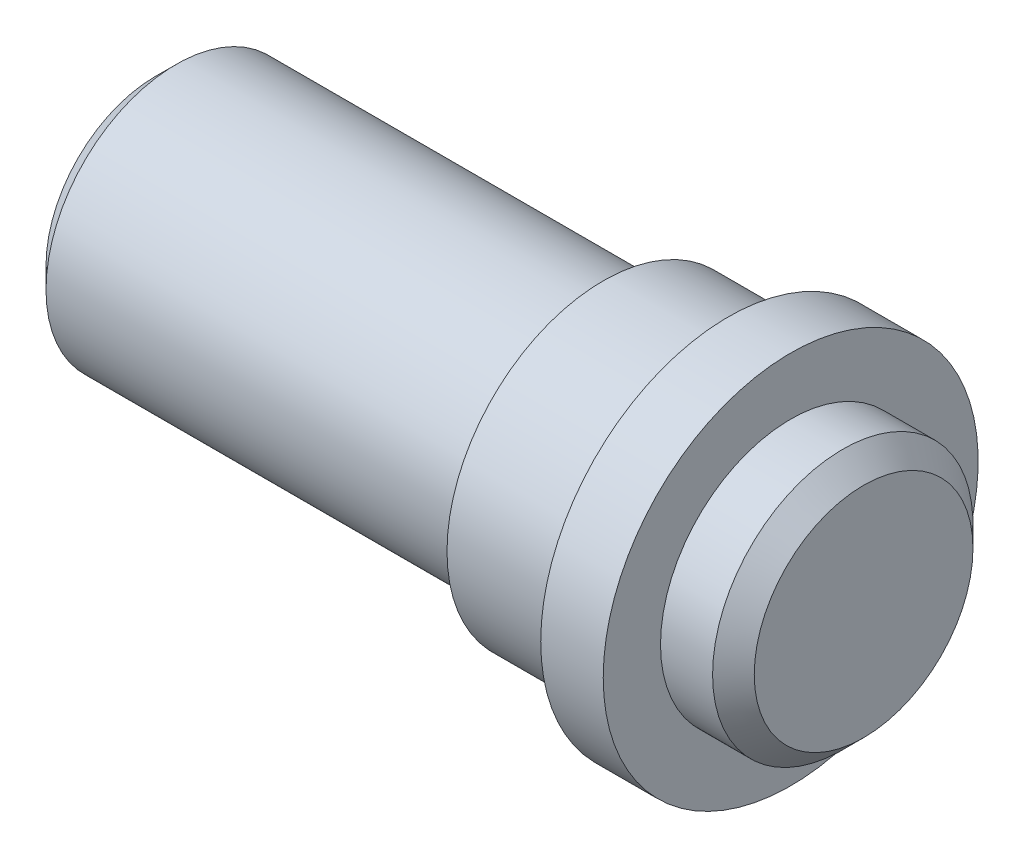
from build123d import *

# Parameters (mm, degrees)
CHANFREIN1_SIZE                  = 2
TROU_TARAUD_M8X1_251_D           = 6.8
TROU_TARAUD_M8X1_251_DEPTH       = 23.75
TROU_TARAUD_M8X1_251_CBORE_D     = 8
TROU_TARAUD_M8X1_251_CBORE_DEPTH = 20
TROU_TARAUD_M8X1_251_TIP         = 2.042926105


with BuildPart() as part:
    # Esquisse1 → R_volution1 (revolve)
    with BuildSketch(Plane.XY, mode=Mode.PRIVATE) as r_volution1_sk:
        Polygon((0, 0), (0, 12.5), (43, 12.5), (43, 15), (55, 15), (55, 18), (61, 18), (61, 12.5), (68, 12.5), (68, 0), align=None)
    revolve(r_volution1_sk.sketch.rotate(Axis((0, 0, 0), (1, 0, 0)), 90), axis=Axis((0, 0, 0), (1, 0, 0)))

    # Chanfrein1
    chanfrein1_edges = [part.edges().sort_by_distance(p)[0] for p in [
        (68, 0, -12.5),
        (0, 0, -12.5),
    ]]
    chamfer(chanfrein1_edges, length=CHANFREIN1_SIZE)

    # Trou taraud_ M8x1.251
    with Locations(Plane.ZY):
        with Locations((0, 0)):
            CounterBoreHole(TROU_TARAUD_M8X1_251_D / 2, TROU_TARAUD_M8X1_251_CBORE_D / 2, TROU_TARAUD_M8X1_251_CBORE_DEPTH, depth=TROU_TARAUD_M8X1_251_DEPTH)
            with Locations((0, 0, -(TROU_TARAUD_M8X1_251_DEPTH + TROU_TARAUD_M8X1_251_TIP / 2))):  # 118° drill point
                Cone(0, TROU_TARAUD_M8X1_251_D / 2, TROU_TARAUD_M8X1_251_TIP, mode=Mode.SUBTRACT)


solid = part.part
